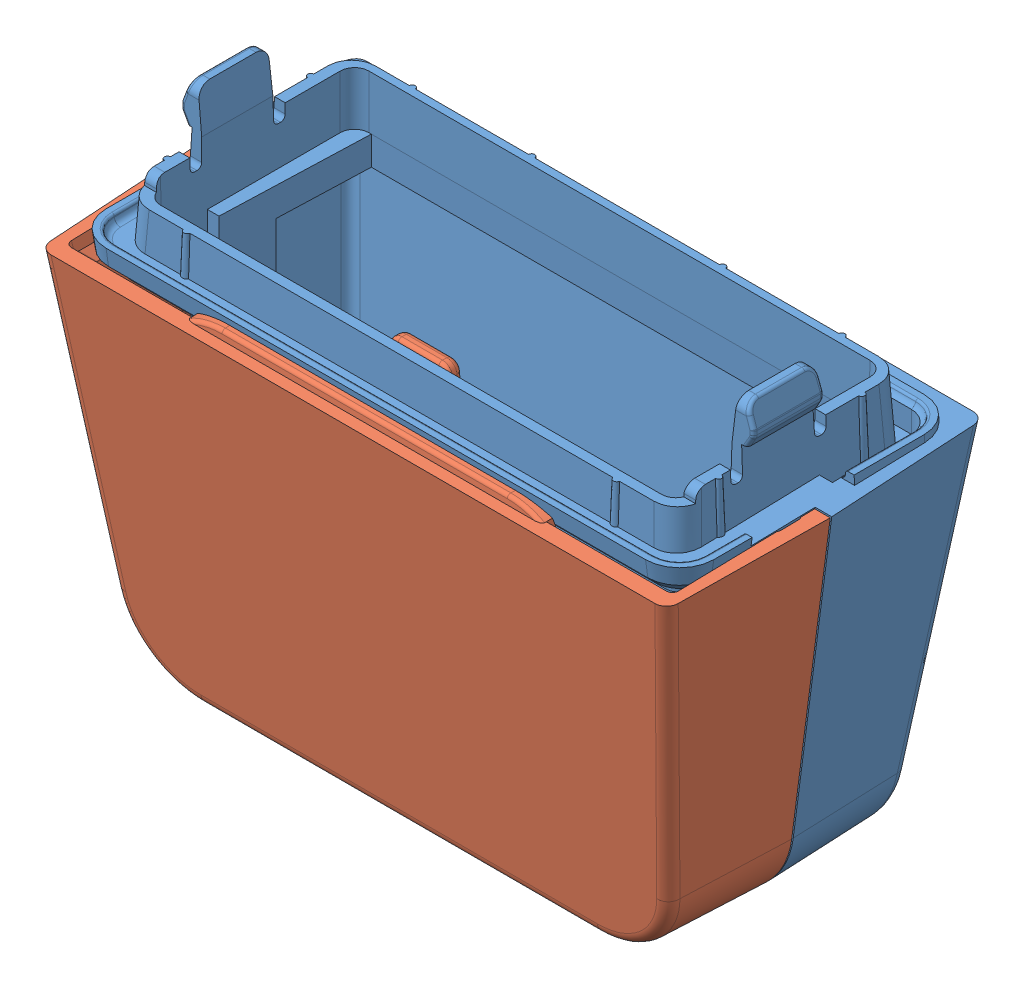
SolidWorks assembly Rain_Cover-LR_Assy.SLDASM, configuration 預設 (file format 15000). Lengths in mm.
Overall size (53.56 39.89 26.69).
3 component instances, 3 part files, 3 mates.
Components (placement in the parent):
- 605-00010-0A_OAK-D-LR_Rain-Base-housing-1: 605-00010-0A_OAK-D-LR_Rain-Base-housing.SLDPRT [預設] at (-0.0066 -0.0005 -0.0337) size (53.55 39.89 24.71)
- 605-00009-0A_OAK-D-LR_Rain-Top-Cover-1: 605-00009-0A_OAK-D-LR_Rain-Top-Cover.SLDPRT [預設] at origin size (53.55 38 19.15)
- OAK-D-LR-asm0001-20230328_asm.stp-1: OAK-D-LR-asm0001-20230328_asm.stp.SLDPRT [預設] at origin (suppressed, hidden)
Mates (geometry in assembly coordinates):
- 平行相距1: distance = 15 mm: plane of Cable_Bottom-Rain cover-1 through (-0.0066 -21.4026 -0.5941) normal (0 0.999657 0.026177); plane of Cable_Top-Rain cover-1 through (65.54 -21.5707 5.88) normal (0 0.999657 0.026177)
- 重合/共線/共點2: coincident aligned: plane of Cable_Bottom-Rain cover-1 through (0 0 0) normal (0 0 1); plane of Cable_Top-Rain cover-1 through (0 0 0) normal (0 0 1)
- 重合/共線/共點3: coincident aligned: plane of Cable_Bottom-Rain cover-1 through (0 0 0) normal (1 0 0); plane of Cable_Top-Rain cover-1 through (0 0 0) normal (1 0 0)
